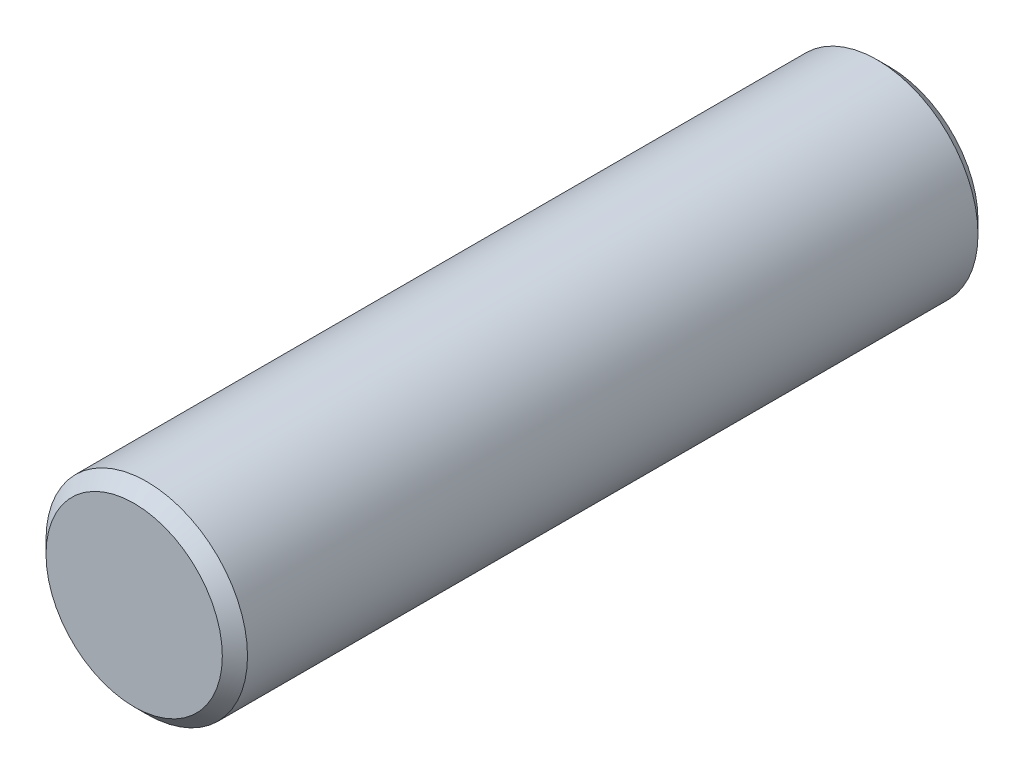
ISO-10303-21;
HEADER;
FILE_DESCRIPTION(('STEP AP214'),'2;1');
FILE_NAME('part.step','',(''),(''),'','','');
FILE_SCHEMA(('AUTOMOTIVE_DESIGN { 1 0 10303 214 1 1 1 1 }'));
ENDSEC;
DATA;
#1=APPLICATION_CONTEXT('core data for automotive mechanical design processes');
#2=APPLICATION_PROTOCOL_DEFINITION('international standard','automotive_design',2000,#1);
#3=PRODUCT_CONTEXT('',#1,'mechanical');
#4=PRODUCT('Part','Part','',(#3));
#5=PRODUCT_RELATED_PRODUCT_CATEGORY('part','',(#4));
#6=PRODUCT_DEFINITION_FORMATION('','',#4);
#7=PRODUCT_DEFINITION_CONTEXT('part definition',#1,'design');
#8=PRODUCT_DEFINITION('design','',#6,#7);
#9=PRODUCT_DEFINITION_SHAPE('','',#8);
#10=(LENGTH_UNIT() NAMED_UNIT(*) SI_UNIT(.MILLI.,.METRE.));
#11=(NAMED_UNIT(*) PLANE_ANGLE_UNIT() SI_UNIT($,.RADIAN.));
#12=(NAMED_UNIT(*) SI_UNIT($,.STERADIAN.) SOLID_ANGLE_UNIT());
#13=UNCERTAINTY_MEASURE_WITH_UNIT(LENGTH_MEASURE(1.E-05),#10,'distance_accuracy_value','');
#14=(GEOMETRIC_REPRESENTATION_CONTEXT(3) GLOBAL_UNCERTAINTY_ASSIGNED_CONTEXT((#13)) GLOBAL_UNIT_ASSIGNED_CONTEXT((#10,
#11,#12)) REPRESENTATION_CONTEXT('',''));
#15=CARTESIAN_POINT('',(0.,0.,0.));
#16=DIRECTION('',(0.,0.,1.));
#17=DIRECTION('',(1.,0.,0.));
#18=AXIS2_PLACEMENT_3D('',#15,#16,#17);
#19=CARTESIAN_POINT('',(0.,0.,60.));
#20=DIRECTION('',(0.,0.,-1.));
#21=DIRECTION('',(-1.,0.,0.));
#22=AXIS2_PLACEMENT_3D('',#19,#20,#21);
#23=CYLINDRICAL_SURFACE('',#22,8.);
#24=CARTESIAN_POINT('',(0.,0.,1.00000000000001));
#25=DIRECTION('',(0.,0.,1.));
#26=DIRECTION('',(1.,0.,0.));
#27=AXIS2_PLACEMENT_3D('',#24,#25,#26);
#28=CIRCLE('',#27,8.);
#29=CARTESIAN_POINT('',(8.,0.,1.00000000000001));
#30=VERTEX_POINT('',#29);
#31=EDGE_CURVE('E41',#30,#30,#28,.T.);
#32=ORIENTED_EDGE('',*,*,#31,.T.);
#33=EDGE_LOOP('',(#32));
#34=FACE_BOUND('',#33,.T.);
#35=CARTESIAN_POINT('',(0.,0.,59.));
#36=DIRECTION('',(0.,0.,1.));
#37=DIRECTION('',(1.,0.,0.));
#38=AXIS2_PLACEMENT_3D('',#35,#36,#37);
#39=CIRCLE('',#38,8.);
#40=CARTESIAN_POINT('',(8.,0.,59.));
#41=VERTEX_POINT('',#40);
#42=EDGE_CURVE('E45',#41,#41,#39,.F.);
#43=ORIENTED_EDGE('',*,*,#42,.T.);
#44=EDGE_LOOP('',(#43));
#45=FACE_BOUND('',#44,.T.);
#46=ADVANCED_FACE('F30',(#34,#45),#23,.T.);
#47=CARTESIAN_POINT('',(0.,0.,60.));
#48=DIRECTION('',(0.,0.,1.));
#49=DIRECTION('',(1.,0.,0.));
#50=AXIS2_PLACEMENT_3D('',#47,#48,#49);
#51=PLANE('',#50);
#52=CARTESIAN_POINT('',(0.,0.,60.));
#53=DIRECTION('',(0.,0.,1.));
#54=DIRECTION('',(1.,0.,0.));
#55=AXIS2_PLACEMENT_3D('',#52,#53,#54);
#56=CIRCLE('',#55,7.);
#57=CARTESIAN_POINT('',(7.,0.,60.));
#58=VERTEX_POINT('',#57);
#59=EDGE_CURVE('E10',#58,#58,#56,.T.);
#60=ORIENTED_EDGE('',*,*,#59,.T.);
#61=EDGE_LOOP('',(#60));
#62=FACE_BOUND('',#61,.T.);
#63=ADVANCED_FACE('F61',(#62),#51,.T.);
#64=CARTESIAN_POINT('',(0.,0.,0.));
#65=DIRECTION('',(0.,0.,1.));
#66=DIRECTION('',(1.,0.,0.));
#67=AXIS2_PLACEMENT_3D('',#64,#65,#66);
#68=PLANE('',#67);
#69=CARTESIAN_POINT('',(0.,0.,0.));
#70=DIRECTION('',(0.,0.,1.));
#71=DIRECTION('',(1.,0.,0.));
#72=AXIS2_PLACEMENT_3D('',#69,#70,#71);
#73=CIRCLE('',#72,6.99999999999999);
#74=CARTESIAN_POINT('',(6.99999999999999,0.,0.));
#75=VERTEX_POINT('',#74);
#76=EDGE_CURVE('E37',#75,#75,#73,.F.);
#77=ORIENTED_EDGE('',*,*,#76,.T.);
#78=EDGE_LOOP('',(#77));
#79=FACE_BOUND('',#78,.T.);
#80=ADVANCED_FACE('F58',(#79),#68,.F.);
#81=CARTESIAN_POINT('',(0.,0.,1.00000000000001));
#82=DIRECTION('',(0.,0.,1.));
#83=DIRECTION('',(1.,0.,0.));
#84=AXIS2_PLACEMENT_3D('',#81,#82,#83);
#85=CONICAL_SURFACE('',#84,8.,0.785398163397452);
#86=ORIENTED_EDGE('',*,*,#76,.F.);
#87=EDGE_LOOP('',(#86));
#88=FACE_BOUND('',#87,.T.);
#89=ORIENTED_EDGE('',*,*,#31,.F.);
#90=EDGE_LOOP('',(#89));
#91=FACE_BOUND('',#90,.T.);
#92=ADVANCED_FACE('F54',(#88,#91),#85,.T.);
#93=CARTESIAN_POINT('',(0.,0.,60.));
#94=DIRECTION('',(0.,0.,-1.));
#95=DIRECTION('',(-1.,0.,0.));
#96=AXIS2_PLACEMENT_3D('',#93,#94,#95);
#97=CONICAL_SURFACE('',#96,7.,0.785398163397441);
#98=ORIENTED_EDGE('',*,*,#42,.F.);
#99=EDGE_LOOP('',(#98));
#100=FACE_BOUND('',#99,.T.);
#101=ORIENTED_EDGE('',*,*,#59,.F.);
#102=EDGE_LOOP('',(#101));
#103=FACE_BOUND('',#102,.T.);
#104=ADVANCED_FACE('F32',(#100,#103),#97,.T.);
#105=CLOSED_SHELL('',(#46,#63,#80,#92,#104));
#106=MANIFOLD_SOLID_BREP('B2',#105);
#107=ADVANCED_BREP_SHAPE_REPRESENTATION('',(#18,#106),#14);
#108=SHAPE_DEFINITION_REPRESENTATION(#9,#107);
ENDSEC;
END-ISO-10303-21;
